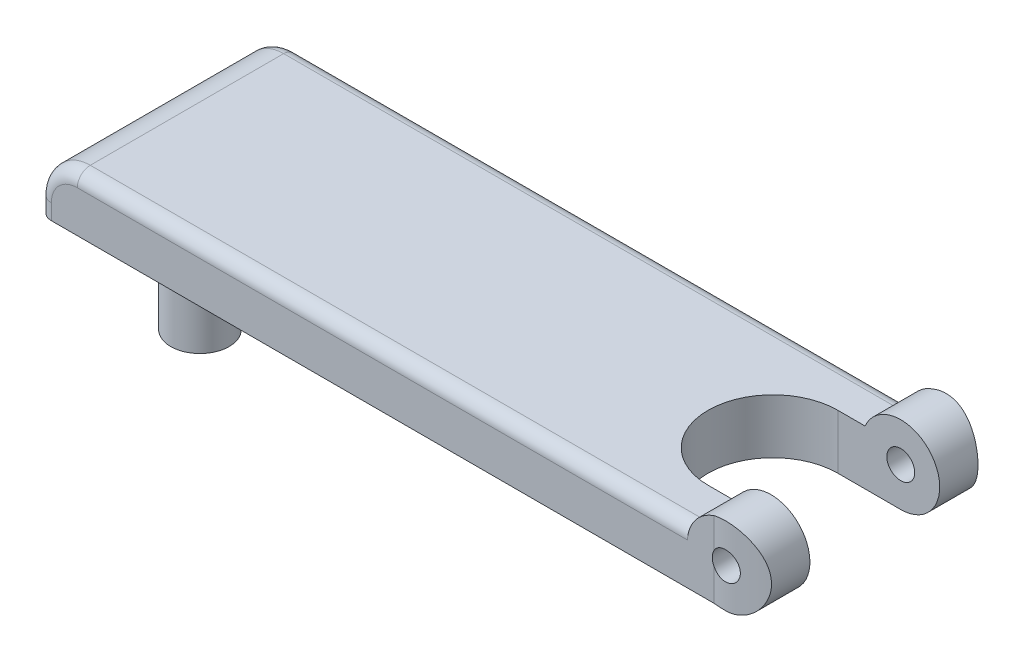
ISO-10303-21;
HEADER;
FILE_DESCRIPTION(('STEP AP214'),'2;1');
FILE_NAME('part.step','',(''),(''),'','','');
FILE_SCHEMA(('AUTOMOTIVE_DESIGN { 1 0 10303 214 1 1 1 1 }'));
ENDSEC;
DATA;
#1=APPLICATION_CONTEXT('core data for automotive mechanical design processes');
#2=APPLICATION_PROTOCOL_DEFINITION('international standard','automotive_design',2000,#1);
#3=PRODUCT_CONTEXT('',#1,'mechanical');
#4=PRODUCT('Part','Part','',(#3));
#5=PRODUCT_RELATED_PRODUCT_CATEGORY('part','',(#4));
#6=PRODUCT_DEFINITION_FORMATION('','',#4);
#7=PRODUCT_DEFINITION_CONTEXT('part definition',#1,'design');
#8=PRODUCT_DEFINITION('design','',#6,#7);
#9=PRODUCT_DEFINITION_SHAPE('','',#8);
#10=(LENGTH_UNIT() NAMED_UNIT(*) SI_UNIT(.MILLI.,.METRE.));
#11=(NAMED_UNIT(*) PLANE_ANGLE_UNIT() SI_UNIT($,.RADIAN.));
#12=(NAMED_UNIT(*) SI_UNIT($,.STERADIAN.) SOLID_ANGLE_UNIT());
#13=UNCERTAINTY_MEASURE_WITH_UNIT(LENGTH_MEASURE(1.E-05),#10,'distance_accuracy_value','');
#14=(GEOMETRIC_REPRESENTATION_CONTEXT(3) GLOBAL_UNCERTAINTY_ASSIGNED_CONTEXT((#13)) GLOBAL_UNIT_ASSIGNED_CONTEXT((#10,
#11,#12)) REPRESENTATION_CONTEXT('',''));
#15=CARTESIAN_POINT('',(0.,0.,0.));
#16=DIRECTION('',(0.,0.,1.));
#17=DIRECTION('',(1.,0.,0.));
#18=AXIS2_PLACEMENT_3D('',#15,#16,#17);
#19=CARTESIAN_POINT('',(-53.,0.,8.5));
#20=DIRECTION('',(0.,1.,0.));
#21=DIRECTION('',(0.,0.,1.));
#22=AXIS2_PLACEMENT_3D('',#19,#20,#21);
#23=PLANE('',#22);
#24=DIRECTION('',(0.,0.,1.));
#25=VECTOR('',#24,1.);
#26=CARTESIAN_POINT('',(-53.,0.,-8.5));
#27=LINE('',#26,#25);
#28=CARTESIAN_POINT('',(-53.,0.,-7.45000000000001));
#29=VERTEX_POINT('',#28);
#30=CARTESIAN_POINT('',(-53.,0.,7.44999999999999));
#31=VERTEX_POINT('',#30);
#32=EDGE_CURVE('E287',#29,#31,#27,.T.);
#33=ORIENTED_EDGE('',*,*,#32,.F.);
#34=CARTESIAN_POINT('',(-52.,0.,-7.45000000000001));
#35=DIRECTION('',(0.,1.,0.));
#36=DIRECTION('',(0.,0.,1.));
#37=AXIS2_PLACEMENT_3D('',#34,#35,#36);
#38=CIRCLE('',#37,1.);
#39=CARTESIAN_POINT('',(-52.,0.,-8.45000000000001));
#40=VERTEX_POINT('',#39);
#41=EDGE_CURVE('E397',#29,#40,#38,.F.);
#42=ORIENTED_EDGE('',*,*,#41,.T.);
#43=DIRECTION('',(1.,0.,0.));
#44=VECTOR('',#43,1.);
#45=CARTESIAN_POINT('',(-54.6802441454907,0.,-8.45000000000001));
#46=LINE('',#45,#44);
#47=CARTESIAN_POINT('',(-0.920597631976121,0.,-8.45));
#48=VERTEX_POINT('',#47);
#49=EDGE_CURVE('E174',#40,#48,#46,.T.);
#50=ORIENTED_EDGE('',*,*,#49,.T.);
#51=CARTESIAN_POINT('',(0.,0.,0.));
#52=DIRECTION('',(0.,-1.,0.));
#53=DIRECTION('',(0.,0.,-1.));
#54=AXIS2_PLACEMENT_3D('',#51,#52,#53);
#55=CIRCLE('',#54,8.5);
#56=CARTESIAN_POINT('',(0.,0.,-8.5));
#57=VERTEX_POINT('',#56);
#58=EDGE_CURVE('E188',#48,#57,#55,.T.);
#59=ORIENTED_EDGE('',*,*,#58,.T.);
#60=DIRECTION('',(0.,0.,-1.));
#61=VECTOR('',#60,1.);
#62=CARTESIAN_POINT('',(0.,0.,-8.5));
#63=LINE('',#62,#61);
#64=CARTESIAN_POINT('',(0.,0.,-5.));
#65=VERTEX_POINT('',#64);
#66=EDGE_CURVE('E288',#65,#57,#63,.T.);
#67=ORIENTED_EDGE('',*,*,#66,.F.);
#68=DIRECTION('',(-1.,0.,0.));
#69=VECTOR('',#68,1.);
#70=CARTESIAN_POINT('',(6.87386354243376,0.,-5.));
#71=LINE('',#70,#69);
#72=CARTESIAN_POINT('',(-4.85,0.,-5.));
#73=VERTEX_POINT('',#72);
#74=EDGE_CURVE('E191',#65,#73,#71,.T.);
#75=ORIENTED_EDGE('',*,*,#74,.T.);
#76=CARTESIAN_POINT('',(-4.85,0.,0.));
#77=DIRECTION('',(0.,1.,0.));
#78=DIRECTION('',(0.,0.,-1.));
#79=AXIS2_PLACEMENT_3D('',#76,#77,#78);
#80=CIRCLE('',#79,5.);
#81=CARTESIAN_POINT('',(-4.85,0.,5.));
#82=VERTEX_POINT('',#81);
#83=EDGE_CURVE('E183',#73,#82,#80,.T.);
#84=ORIENTED_EDGE('',*,*,#83,.T.);
#85=DIRECTION('',(1.,0.,0.));
#86=VECTOR('',#85,1.);
#87=CARTESIAN_POINT('',(6.87386354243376,0.,5.));
#88=LINE('',#87,#86);
#89=CARTESIAN_POINT('',(0.,0.,5.));
#90=VERTEX_POINT('',#89);
#91=EDGE_CURVE('E181',#82,#90,#88,.T.);
#92=ORIENTED_EDGE('',*,*,#91,.T.);
#93=CARTESIAN_POINT('',(0.,0.,8.5));
#94=VERTEX_POINT('',#93);
#95=EDGE_CURVE('E180',#94,#90,#63,.T.);
#96=ORIENTED_EDGE('',*,*,#95,.F.);
#97=CARTESIAN_POINT('',(0.,0.,0.));
#98=DIRECTION('',(0.,-1.,0.));
#99=DIRECTION('',(0.,0.,-1.));
#100=AXIS2_PLACEMENT_3D('',#97,#98,#99);
#101=CIRCLE('',#100,8.5);
#102=CARTESIAN_POINT('',(-0.920597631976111,0.,8.45));
#103=VERTEX_POINT('',#102);
#104=EDGE_CURVE('E160',#94,#103,#101,.T.);
#105=ORIENTED_EDGE('',*,*,#104,.T.);
#106=DIRECTION('',(-1.,0.,0.));
#107=VECTOR('',#106,1.);
#108=CARTESIAN_POINT('',(-0.920597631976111,0.,8.45));
#109=LINE('',#108,#107);
#110=CARTESIAN_POINT('',(-52.,0.,8.44999999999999));
#111=VERTEX_POINT('',#110);
#112=EDGE_CURVE('E170',#103,#111,#109,.T.);
#113=ORIENTED_EDGE('',*,*,#112,.T.);
#114=CARTESIAN_POINT('',(-52.,0.,7.44999999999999));
#115=DIRECTION('',(0.,1.,0.));
#116=DIRECTION('',(0.,0.,1.));
#117=AXIS2_PLACEMENT_3D('',#114,#115,#116);
#118=CIRCLE('',#117,1.);
#119=EDGE_CURVE('E51',#111,#31,#118,.F.);
#120=ORIENTED_EDGE('',*,*,#119,.T.);
#121=EDGE_LOOP('',(#33,#42,#50,#59,#67,#75,#84,#92,#96,#105,#113,#120));
#122=FACE_BOUND('',#121,.T.);
#123=CARTESIAN_POINT('',(-49.,0.,0.));
#124=DIRECTION('',(0.,1.,0.));
#125=DIRECTION('',(0.,0.,1.));
#126=AXIS2_PLACEMENT_3D('',#123,#124,#125);
#127=CIRCLE('',#126,2.25);
#128=CARTESIAN_POINT('',(-49.,0.,2.25));
#129=VERTEX_POINT('',#128);
#130=EDGE_CURVE('E13',#129,#129,#127,.F.);
#131=ORIENTED_EDGE('',*,*,#130,.F.);
#132=EDGE_LOOP('',(#131));
#133=FACE_BOUND('',#132,.T.);
#134=ADVANCED_FACE('F36',(#122,#133),#23,.F.);
#135=CARTESIAN_POINT('',(0.,3.,-8.5));
#136=DIRECTION('',(0.,0.,1.));
#137=DIRECTION('',(1.,0.,0.));
#138=AXIS2_PLACEMENT_3D('',#135,#136,#137);
#139=CYLINDRICAL_SURFACE('',#138,1.075);
#140=CARTESIAN_POINT('',(-0.920597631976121,2.44490991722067,-8.45));
#141=CARTESIAN_POINT('',(-0.90495556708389,2.41896870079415,-8.45170372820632));
#142=CARTESIAN_POINT('',(-0.888226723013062,2.39370504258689,-8.45348270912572));
#143=CARTESIAN_POINT('',(-0.852703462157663,2.34468404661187,-8.45714004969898));
#144=CARTESIAN_POINT('',(-0.833909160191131,2.32092662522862,-8.45901840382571));
#145=CARTESIAN_POINT('',(-0.774643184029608,2.2522011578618,-8.46472076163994));
#146=CARTESIAN_POINT('',(-0.731243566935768,2.20970566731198,-8.46861717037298));
#147=CARTESIAN_POINT('',(-0.637907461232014,2.13260755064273,-8.47615858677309));
#148=CARTESIAN_POINT('',(-0.587968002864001,2.09800853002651,-8.47980347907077));
#149=CARTESIAN_POINT('',(-0.482953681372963,2.03768818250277,-8.48643142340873));
#150=CARTESIAN_POINT('',(-0.42788009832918,2.01196465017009,-8.48941463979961));
#151=CARTESIAN_POINT('',(-0.314272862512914,1.97018773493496,-8.49437789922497));
#152=CARTESIAN_POINT('',(-0.25574693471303,1.95411359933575,-8.49636009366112));
#153=CARTESIAN_POINT('',(-0.136789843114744,1.93202385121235,-8.49910738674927));
#154=CARTESIAN_POINT('',(-0.0763584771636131,1.92600930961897,-8.49987235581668));
#155=CARTESIAN_POINT('',(0.0442278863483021,1.92423074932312,-8.50009728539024));
#156=CARTESIAN_POINT('',(0.1043818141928,1.92839450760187,-8.49956644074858));
#157=CARTESIAN_POINT('',(0.223123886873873,1.9466960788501,-8.49727856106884));
#158=CARTESIAN_POINT('',(0.281712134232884,1.96083323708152,-8.49552160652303));
#159=CARTESIAN_POINT('',(0.395631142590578,1.99865063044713,-8.49097909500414));
#160=CARTESIAN_POINT('',(0.450964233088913,2.02232394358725,-8.48819428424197));
#161=CARTESIAN_POINT('',(0.55688530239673,2.07853432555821,-8.48190410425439));
#162=CARTESIAN_POINT('',(0.60747297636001,2.11107196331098,-8.47839868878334));
#163=CARTESIAN_POINT('',(0.702829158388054,2.18434349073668,-8.47102927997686));
#164=CARTESIAN_POINT('',(0.747556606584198,2.22513059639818,-8.46716305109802));
#165=CARTESIAN_POINT('',(0.829551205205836,2.31362645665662,-8.45952389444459));
#166=CARTESIAN_POINT('',(0.866818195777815,2.36133535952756,-8.45575096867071));
#167=CARTESIAN_POINT('',(0.93297262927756,2.46254685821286,-8.44870859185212));
#168=CARTESIAN_POINT('',(0.961827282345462,2.51607103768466,-8.44544113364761));
#169=CARTESIAN_POINT('',(1.01012756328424,2.62725277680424,-8.4398007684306));
#170=CARTESIAN_POINT('',(1.02957352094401,2.68491019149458,-8.43742783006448));
#171=CARTESIAN_POINT('',(1.05840746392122,2.8024149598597,-8.43385947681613));
#172=CARTESIAN_POINT('',(1.0678455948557,2.8622498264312,-8.43265819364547));
#173=CARTESIAN_POINT('',(1.07655380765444,2.98266567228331,-8.43155098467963));
#174=CARTESIAN_POINT('',(1.07582431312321,3.04324662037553,-8.4316450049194));
#175=CARTESIAN_POINT('',(1.06425613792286,3.16304393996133,-8.43311279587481));
#176=CARTESIAN_POINT('',(1.05347918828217,3.22226638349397,-8.43447875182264));
#177=CARTESIAN_POINT('',(1.02222322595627,3.33805449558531,-8.43832360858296));
#178=CARTESIAN_POINT('',(1.0017440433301,3.39462011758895,-8.44080252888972));
#179=CARTESIAN_POINT('',(0.95161603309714,3.50364734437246,-8.44660059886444));
#180=CARTESIAN_POINT('',(0.921945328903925,3.55609877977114,-8.44992174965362));
#181=CARTESIAN_POINT('',(0.854290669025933,3.65529945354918,-8.45702906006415));
#182=CARTESIAN_POINT('',(0.816306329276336,3.70204842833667,-8.46081524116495));
#183=CARTESIAN_POINT('',(0.732779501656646,3.78886849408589,-8.46845920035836));
#184=CARTESIAN_POINT('',(0.687184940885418,3.82888947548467,-8.47231729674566));
#185=CARTESIAN_POINT('',(0.589901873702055,3.90072009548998,-8.47964569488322));
#186=CARTESIAN_POINT('',(0.538213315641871,3.93252966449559,-8.48311599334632));
#187=CARTESIAN_POINT('',(0.430144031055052,3.98704946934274,-8.4892817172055));
#188=CARTESIAN_POINT('',(0.373759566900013,4.00975237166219,-8.49197651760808));
#189=CARTESIAN_POINT('',(0.257936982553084,4.04535333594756,-8.4962829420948));
#190=CARTESIAN_POINT('',(0.198499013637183,4.05825188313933,-8.49789461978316));
#191=CARTESIAN_POINT('',(0.0786820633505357,4.07380599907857,-8.49984554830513));
#192=CARTESIAN_POINT('',(0.0183120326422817,4.07652948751,-8.50019323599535));
#193=CARTESIAN_POINT('',(-0.102024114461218,4.0718401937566,-8.49960065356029));
#194=CARTESIAN_POINT('',(-0.161990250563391,4.06442790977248,-8.49866044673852));
#195=CARTESIAN_POINT('',(-0.279580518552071,4.03973826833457,-8.49560374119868));
#196=CARTESIAN_POINT('',(-0.337212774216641,4.02249897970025,-8.4934917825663));
#197=CARTESIAN_POINT('',(-0.448780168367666,3.9786794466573,-8.48832835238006));
#198=CARTESIAN_POINT('',(-0.502714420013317,3.95209697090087,-8.48527665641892));
#199=CARTESIAN_POINT('',(-0.605653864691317,3.89018961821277,-8.478553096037));
#200=CARTESIAN_POINT('',(-0.654630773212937,3.8548181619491,-8.47487796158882));
#201=CARTESIAN_POINT('',(-0.745941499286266,3.77640755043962,-8.46732960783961));
#202=CARTESIAN_POINT('',(-0.788282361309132,3.73337663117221,-8.46345660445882));
#203=CARTESIAN_POINT('',(-0.844001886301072,3.66634915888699,-8.45801185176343));
#204=CARTESIAN_POINT('',(-0.860506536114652,3.64489270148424,-8.45634545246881));
#205=CARTESIAN_POINT('',(-0.891825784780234,3.60083256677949,-8.45309958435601));
#206=CARTESIAN_POINT('',(-0.906643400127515,3.57823104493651,-8.45151996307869));
#207=CARTESIAN_POINT('',(-0.920597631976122,3.55509008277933,-8.45));
#208=B_SPLINE_CURVE_WITH_KNOTS('',3,(#140,#141,#142,#143,#144,#145,#146,#147,#148,#149,#150,
#151,#152,#153,#154,#155,#156,#157,#158,#159,#160,#161,#162,#163,#164,#165,#166,#167,#168,#169,
#170,#171,#172,#173,#174,#175,#176,#177,#178,#179,#180,#181,#182,#183,#184,#185,#186,#187,#188,
#189,#190,#191,#192,#193,#194,#195,#196,#197,#198,#199,#200,#201,#202,#203,#204,#205,#206,#207),
.UNSPECIFIED.,.F.,.F.,(4,2,2,2,2,2,2,2,2,2,2,2,2,2,2,2,2,2,2,2,2,2,2,2,2,2,2,2,2,2,2,2,2,4),(0.,
0.0909640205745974,0.181922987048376,0.36358353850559,0.545326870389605,0.72702500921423,
0.908330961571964,1.08965621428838,1.26969856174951,1.44972909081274,1.6296291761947,
1.80954081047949,1.99065232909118,2.17176772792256,2.35357992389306,2.53538574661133,
2.7162762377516,2.89715919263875,3.07693808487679,3.25672012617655,3.4369333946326,
3.61715499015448,3.79866450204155,3.98017555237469,4.16183247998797,4.34348041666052,
4.52391364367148,4.70433800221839,4.88406811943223,5.06384118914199,5.24458812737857,
5.42514187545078,5.50644120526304,5.5875928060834),.UNSPECIFIED.);
#209=CARTESIAN_POINT('',(-0.920597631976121,2.44490991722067,-8.45));
#210=VERTEX_POINT('',#209);
#211=CARTESIAN_POINT('',(-0.920597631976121,3.55509008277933,-8.45));
#212=VERTEX_POINT('',#211);
#213=EDGE_CURVE('E247',#210,#212,#208,.T.);
#214=ORIENTED_EDGE('',*,*,#213,.F.);
#215=CARTESIAN_POINT('',(0.,3.,-8.45));
#216=DIRECTION('',(0.,0.,-1.));
#217=DIRECTION('',(-1.,0.,0.));
#218=AXIS2_PLACEMENT_3D('',#215,#216,#217);
#219=CIRCLE('',#218,1.075);
#220=EDGE_CURVE('E255',#212,#210,#219,.F.);
#221=ORIENTED_EDGE('',*,*,#220,.F.);
#222=EDGE_LOOP('',(#214,#221));
#223=FACE_BOUND('',#222,.T.);
#224=CARTESIAN_POINT('',(0.,3.,-5.));
#225=DIRECTION('',(0.,0.,1.));
#226=DIRECTION('',(1.,0.,0.));
#227=AXIS2_PLACEMENT_3D('',#224,#225,#226);
#228=CIRCLE('',#227,1.075);
#229=CARTESIAN_POINT('',(1.075,3.,-5.));
#230=VERTEX_POINT('',#229);
#231=EDGE_CURVE('E256',#230,#230,#228,.F.);
#232=ORIENTED_EDGE('',*,*,#231,.F.);
#233=EDGE_LOOP('',(#232));
#234=FACE_BOUND('',#233,.T.);
#235=ADVANCED_FACE('F239',(#223,#234),#139,.F.);
#236=CARTESIAN_POINT('',(6.87386354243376,17.,-5.));
#237=DIRECTION('',(0.,0.,1.));
#238=DIRECTION('',(1.,0.,0.));
#239=AXIS2_PLACEMENT_3D('',#236,#237,#238);
#240=PLANE('',#239);
#241=DIRECTION('',(0.,-1.,0.));
#242=VECTOR('',#241,1.);
#243=CARTESIAN_POINT('',(-4.85,17.,-5.));
#244=LINE('',#243,#242);
#245=CARTESIAN_POINT('',(-4.85,4.2,-5.));
#246=VERTEX_POINT('',#245);
#247=EDGE_CURVE('E194',#246,#73,#244,.T.);
#248=ORIENTED_EDGE('',*,*,#247,.T.);
#249=ORIENTED_EDGE('',*,*,#74,.F.);
#250=CARTESIAN_POINT('',(0.,3.,-5.));
#251=DIRECTION('',(0.,0.,1.));
#252=DIRECTION('',(1.,0.,0.));
#253=AXIS2_PLACEMENT_3D('',#250,#251,#252);
#254=CIRCLE('',#253,3.);
#255=CARTESIAN_POINT('',(-2.74954541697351,4.2,-5.));
#256=VERTEX_POINT('',#255);
#257=EDGE_CURVE('E274',#256,#65,#254,.F.);
#258=ORIENTED_EDGE('',*,*,#257,.F.);
#259=DIRECTION('',(1.,0.,0.));
#260=VECTOR('',#259,1.);
#261=CARTESIAN_POINT('',(-53.,4.2,-5.00000000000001));
#262=LINE('',#261,#260);
#263=EDGE_CURVE('E277',#246,#256,#262,.T.);
#264=ORIENTED_EDGE('',*,*,#263,.F.);
#265=EDGE_LOOP('',(#248,#249,#258,#264));
#266=FACE_BOUND('',#265,.T.);
#267=ORIENTED_EDGE('',*,*,#231,.T.);
#268=EDGE_LOOP('',(#267));
#269=FACE_BOUND('',#268,.T.);
#270=ADVANCED_FACE('F242',(#266,#269),#240,.T.);
#271=CARTESIAN_POINT('',(6.87386354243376,17.,5.));
#272=DIRECTION('',(0.,0.,-1.));
#273=DIRECTION('',(-1.,0.,0.));
#274=AXIS2_PLACEMENT_3D('',#271,#272,#273);
#275=PLANE('',#274);
#276=CARTESIAN_POINT('',(0.,3.,5.));
#277=DIRECTION('',(0.,0.,-1.));
#278=DIRECTION('',(-1.,0.,0.));
#279=AXIS2_PLACEMENT_3D('',#276,#277,#278);
#280=CIRCLE('',#279,3.);
#281=CARTESIAN_POINT('',(-2.74954541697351,4.2,5.));
#282=VERTEX_POINT('',#281);
#283=EDGE_CURVE('E202',#90,#282,#280,.F.);
#284=ORIENTED_EDGE('',*,*,#283,.F.);
#285=ORIENTED_EDGE('',*,*,#91,.F.);
#286=DIRECTION('',(0.,-1.,0.));
#287=VECTOR('',#286,1.);
#288=CARTESIAN_POINT('',(-4.85,17.,5.));
#289=LINE('',#288,#287);
#290=CARTESIAN_POINT('',(-4.85,4.2,5.));
#291=VERTEX_POINT('',#290);
#292=EDGE_CURVE('E168',#291,#82,#289,.T.);
#293=ORIENTED_EDGE('',*,*,#292,.F.);
#294=DIRECTION('',(-1.,0.,0.));
#295=VECTOR('',#294,1.);
#296=CARTESIAN_POINT('',(-53.,4.2,4.99999999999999));
#297=LINE('',#296,#295);
#298=EDGE_CURVE('E205',#282,#291,#297,.T.);
#299=ORIENTED_EDGE('',*,*,#298,.F.);
#300=EDGE_LOOP('',(#284,#285,#293,#299));
#301=FACE_BOUND('',#300,.T.);
#302=CARTESIAN_POINT('',(0.,3.,5.));
#303=DIRECTION('',(0.,0.,-1.));
#304=DIRECTION('',(-1.,0.,0.));
#305=AXIS2_PLACEMENT_3D('',#302,#303,#304);
#306=CIRCLE('',#305,1.075);
#307=CARTESIAN_POINT('',(-1.075,3.,5.));
#308=VERTEX_POINT('',#307);
#309=EDGE_CURVE('E196',#308,#308,#306,.F.);
#310=ORIENTED_EDGE('',*,*,#309,.T.);
#311=EDGE_LOOP('',(#310));
#312=FACE_BOUND('',#311,.T.);
#313=ADVANCED_FACE('F227',(#301,#312),#275,.T.);
#314=CARTESIAN_POINT('',(-4.85,17.,0.));
#315=DIRECTION('',(0.,-1.,0.));
#316=DIRECTION('',(0.,0.,-1.));
#317=AXIS2_PLACEMENT_3D('',#314,#315,#316);
#318=CYLINDRICAL_SURFACE('',#317,5.);
#319=ORIENTED_EDGE('',*,*,#292,.T.);
#320=ORIENTED_EDGE('',*,*,#83,.F.);
#321=ORIENTED_EDGE('',*,*,#247,.F.);
#322=CARTESIAN_POINT('',(-4.85,4.2,0.));
#323=DIRECTION('',(0.,1.,0.));
#324=DIRECTION('',(0.,0.,1.));
#325=AXIS2_PLACEMENT_3D('',#322,#323,#324);
#326=CIRCLE('',#325,5.);
#327=EDGE_CURVE('E280',#291,#246,#326,.F.);
#328=ORIENTED_EDGE('',*,*,#327,.F.);
#329=EDGE_LOOP('',(#319,#320,#321,#328));
#330=FACE_BOUND('',#329,.T.);
#331=ADVANCED_FACE('F244',(#330),#318,.F.);
#332=CARTESIAN_POINT('',(0.,17.,0.));
#333=DIRECTION('',(0.,-1.,0.));
#334=DIRECTION('',(0.,0.,-1.));
#335=AXIS2_PLACEMENT_3D('',#332,#333,#334);
#336=CYLINDRICAL_SURFACE('',#335,8.5);
#337=CARTESIAN_POINT('',(0.,0.,-8.5));
#338=CARTESIAN_POINT('',(0.0816967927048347,-1.07410784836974E-05,-8.50001098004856));
#339=CARTESIAN_POINT('',(0.163386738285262,0.00333695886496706,-8.49882243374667));
#340=CARTESIAN_POINT('',(0.32613688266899,0.0166658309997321,-8.49412806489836));
#341=CARTESIAN_POINT('',(0.407197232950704,0.0266453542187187,-8.49062281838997));
#342=CARTESIAN_POINT('',(0.567878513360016,0.0531158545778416,-8.48139024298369));
#343=CARTESIAN_POINT('',(0.647502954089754,0.0695877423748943,-8.47566942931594));
#344=CARTESIAN_POINT('',(0.804972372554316,0.108873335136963,-8.46216736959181));
#345=CARTESIAN_POINT('',(0.88281729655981,0.131687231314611,-8.45438606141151));
#346=CARTESIAN_POINT('',(1.11280527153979,0.209340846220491,-8.42824791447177));
#347=CARTESIAN_POINT('',(1.26162459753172,0.273429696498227,-8.40708320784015));
#348=CARTESIAN_POINT('',(1.5463614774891,0.424192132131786,-8.35940760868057));
#349=CARTESIAN_POINT('',(1.68227166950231,0.510878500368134,-8.33289369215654));
#350=CARTESIAN_POINT('',(1.94256506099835,0.707846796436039,-8.27615740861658));
#351=CARTESIAN_POINT('',(2.06639274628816,0.818836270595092,-8.24583901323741));
#352=CARTESIAN_POINT('',(2.29411313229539,1.05975759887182,-8.18541135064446));
#353=CARTESIAN_POINT('',(2.39800003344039,1.18969494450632,-8.15530214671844));
#354=CARTESIAN_POINT('',(2.586249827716,1.47005323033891,-8.09761343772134));
#355=CARTESIAN_POINT('',(2.66985705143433,1.62100783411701,-8.07014990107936));
#356=CARTESIAN_POINT('',(2.81024930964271,1.9359542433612,-8.02234630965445));
#357=CARTESIAN_POINT('',(2.86704468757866,2.09994099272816,-8.00200350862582));
#358=CARTESIAN_POINT('',(2.95005819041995,2.42990396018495,-7.971766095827));
#359=CARTESIAN_POINT('',(2.9773333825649,2.59558021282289,-7.96151157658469));
#360=CARTESIAN_POINT('',(3.00383763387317,2.92945317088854,-7.95155202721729));
#361=CARTESIAN_POINT('',(3.00307623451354,3.09764899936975,-7.95184340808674));
#362=CARTESIAN_POINT('',(2.9743432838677,3.42247554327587,-7.96262987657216));
#363=CARTESIAN_POINT('',(2.94779009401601,3.57925254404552,-7.97259306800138));
#364=CARTESIAN_POINT('',(2.87055528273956,3.88596316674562,-8.00072396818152));
#365=CARTESIAN_POINT('',(2.81987047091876,4.03589588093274,-8.01889276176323));
#366=CARTESIAN_POINT('',(2.69495250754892,4.32773170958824,-8.0617393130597));
#367=CARTESIAN_POINT('',(2.62032338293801,4.46944875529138,-8.08652525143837));
#368=CARTESIAN_POINT('',(2.44991103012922,4.7387786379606,-8.13977201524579));
#369=CARTESIAN_POINT('',(2.35412127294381,4.86638710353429,-8.16823397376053));
#370=CARTESIAN_POINT('',(2.13744315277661,5.1117954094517,-8.22767671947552));
#371=CARTESIAN_POINT('',(2.01540754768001,5.22857257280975,-8.25870704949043));
#372=CARTESIAN_POINT('',(1.75311116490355,5.44028882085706,-8.31833329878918));
#373=CARTESIAN_POINT('',(1.61284808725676,5.5352251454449,-8.34692891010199));
#374=CARTESIAN_POINT('',(1.31572015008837,5.70151926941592,-8.39892104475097));
#375=CARTESIAN_POINT('',(1.15867301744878,5.77257408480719,-8.42224961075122));
#376=CARTESIAN_POINT('',(0.83380810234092,5.88693287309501,-8.46058246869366));
#377=CARTESIAN_POINT('',(0.665993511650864,5.93024502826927,-8.47558921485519));
#378=CARTESIAN_POINT('',(0.332982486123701,5.9860132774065,-8.49503570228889));
#379=CARTESIAN_POINT('',(0.168041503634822,5.99983968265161,-8.49994432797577));
#380=CARTESIAN_POINT('',(-0.161812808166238,6.00015709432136,-8.50005453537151));
#381=CARTESIAN_POINT('',(-0.326726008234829,5.98667468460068,-8.4952655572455));
#382=CARTESIAN_POINT('',(-0.562304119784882,5.94777342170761,-8.48170181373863));
#383=CARTESIAN_POINT('',(-0.635086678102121,5.93294651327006,-8.47655008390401));
#384=CARTESIAN_POINT('',(-0.7790714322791,5.89801883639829,-8.46452889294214));
#385=CARTESIAN_POINT('',(-0.850276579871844,5.87792901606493,-8.45766299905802));
#386=CARTESIAN_POINT('',(-0.920597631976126,5.85525830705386,-8.45000000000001));
#387=B_SPLINE_CURVE_WITH_KNOTS('',3,(#337,#338,#339,#340,#341,#342,#343,#344,#345,#346,#347,
#348,#349,#350,#351,#352,#353,#354,#355,#356,#357,#358,#359,#360,#361,#362,#363,#364,#365,#366,
#367,#368,#369,#370,#371,#372,#373,#374,#375,#376,#377,#378,#379,#380,#381,#382,#383,#384,#385,
#386),.UNSPECIFIED.,.F.,.F.,(4,2,2,2,2,2,2,2,2,2,2,2,2,2,2,2,2,2,2,2,2,2,2,2,4),(0.,
0.245001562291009,0.489942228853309,0.73416801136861,0.97840115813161,1.46619631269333,
1.95426800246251,2.45908620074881,2.96405099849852,3.48564601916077,4.00703965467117,
4.50907327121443,5.01093603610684,5.48667665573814,5.96248018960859,6.4465971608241,
6.93086371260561,7.44369737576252,7.9565958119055,8.47577528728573,8.99480156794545,
9.48912806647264,9.98297359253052,10.2061556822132,10.42887713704),.UNSPECIFIED.);
#388=CARTESIAN_POINT('',(-0.920597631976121,5.85525830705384,-8.45));
#389=VERTEX_POINT('',#388);
#390=EDGE_CURVE('E267',#57,#389,#387,.T.);
#391=ORIENTED_EDGE('',*,*,#390,.F.);
#392=ORIENTED_EDGE('',*,*,#58,.F.);
#393=DIRECTION('',(0.,-1.,0.));
#394=VECTOR('',#393,1.);
#395=CARTESIAN_POINT('',(-0.920597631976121,17.,-8.45));
#396=LINE('',#395,#394);
#397=EDGE_CURVE('E198',#210,#48,#396,.T.);
#398=ORIENTED_EDGE('',*,*,#397,.F.);
#399=ORIENTED_EDGE('',*,*,#213,.T.);
#400=EDGE_CURVE('E197',#389,#212,#396,.T.);
#401=ORIENTED_EDGE('',*,*,#400,.F.);
#402=EDGE_LOOP('',(#391,#392,#398,#399,#401));
#403=FACE_BOUND('',#402,.T.);
#404=ADVANCED_FACE('F258',(#403),#336,.T.);
#405=CARTESIAN_POINT('',(-54.6802441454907,17.,-8.45000000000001));
#406=DIRECTION('',(0.,0.,-1.));
#407=DIRECTION('',(-1.,0.,0.));
#408=AXIS2_PLACEMENT_3D('',#405,#406,#407);
#409=PLANE('',#408);
#410=DIRECTION('',(-1.,0.,0.));
#411=VECTOR('',#410,1.);
#412=CARTESIAN_POINT('',(-54.6802441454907,3.2,-8.45000000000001));
#413=LINE('',#412,#411);
#414=CARTESIAN_POINT('',(-50.,3.2,-8.45000000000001));
#415=VERTEX_POINT('',#414);
#416=CARTESIAN_POINT('',(-2.99332590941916,3.2,-8.45));
#417=VERTEX_POINT('',#416);
#418=EDGE_CURVE('E304',#415,#417,#413,.F.);
#419=ORIENTED_EDGE('',*,*,#418,.T.);
#420=CARTESIAN_POINT('',(0.,3.,-8.45));
#421=DIRECTION('',(0.,0.,-1.));
#422=DIRECTION('',(-1.,0.,0.));
#423=AXIS2_PLACEMENT_3D('',#420,#421,#422);
#424=CIRCLE('',#423,3.);
#425=EDGE_CURVE('E273',#389,#417,#424,.F.);
#426=ORIENTED_EDGE('',*,*,#425,.F.);
#427=ORIENTED_EDGE('',*,*,#400,.T.);
#428=ORIENTED_EDGE('',*,*,#220,.T.);
#429=ORIENTED_EDGE('',*,*,#397,.T.);
#430=ORIENTED_EDGE('',*,*,#49,.F.);
#431=DIRECTION('',(0.,1.,0.));
#432=VECTOR('',#431,1.);
#433=CARTESIAN_POINT('',(-52.,1.2,-8.45000000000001));
#434=LINE('',#433,#432);
#435=CARTESIAN_POINT('',(-52.,1.2,-8.45000000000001));
#436=VERTEX_POINT('',#435);
#437=EDGE_CURVE('E377',#40,#436,#434,.T.);
#438=ORIENTED_EDGE('',*,*,#437,.T.);
#439=CARTESIAN_POINT('',(-50.,1.2,-8.45000000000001));
#440=DIRECTION('',(0.,0.,-1.));
#441=DIRECTION('',(-1.,0.,0.));
#442=AXIS2_PLACEMENT_3D('',#439,#440,#441);
#443=CIRCLE('',#442,2.);
#444=EDGE_CURVE('E382',#436,#415,#443,.T.);
#445=ORIENTED_EDGE('',*,*,#444,.T.);
#446=EDGE_LOOP('',(#419,#426,#427,#428,#429,#430,#438,#445));
#447=FACE_BOUND('',#446,.T.);
#448=ADVANCED_FACE('F262',(#447),#409,.T.);
#449=CARTESIAN_POINT('',(-53.,4.2,-8.5));
#450=DIRECTION('',(1.,0.,0.));
#451=DIRECTION('',(0.,0.,-1.));
#452=AXIS2_PLACEMENT_3D('',#449,#450,#451);
#453=PLANE('',#452);
#454=DIRECTION('',(0.,0.,1.));
#455=VECTOR('',#454,1.);
#456=CARTESIAN_POINT('',(-53.,1.2,-8.45000000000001));
#457=LINE('',#456,#455);
#458=CARTESIAN_POINT('',(-53.,1.2,7.44999999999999));
#459=VERTEX_POINT('',#458);
#460=CARTESIAN_POINT('',(-53.,1.2,-7.45000000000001));
#461=VERTEX_POINT('',#460);
#462=EDGE_CURVE('E375',#459,#461,#457,.F.);
#463=ORIENTED_EDGE('',*,*,#462,.T.);
#464=DIRECTION('',(0.,1.,0.));
#465=VECTOR('',#464,1.);
#466=CARTESIAN_POINT('',(-53.,0.,-7.45000000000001));
#467=LINE('',#466,#465);
#468=EDGE_CURVE('E58',#461,#29,#467,.F.);
#469=ORIENTED_EDGE('',*,*,#468,.T.);
#470=ORIENTED_EDGE('',*,*,#32,.T.);
#471=DIRECTION('',(0.,-1.,0.));
#472=VECTOR('',#471,1.);
#473=CARTESIAN_POINT('',(-53.,1.2,7.44999999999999));
#474=LINE('',#473,#472);
#475=EDGE_CURVE('E393',#31,#459,#474,.F.);
#476=ORIENTED_EDGE('',*,*,#475,.T.);
#477=EDGE_LOOP('',(#463,#469,#470,#476));
#478=FACE_BOUND('',#477,.T.);
#479=ADVANCED_FACE('F38',(#478),#453,.F.);
#480=CARTESIAN_POINT('',(-53.,4.2,8.5));
#481=DIRECTION('',(0.,1.,0.));
#482=DIRECTION('',(0.,0.,1.));
#483=AXIS2_PLACEMENT_3D('',#480,#481,#482);
#484=PLANE('',#483);
#485=DIRECTION('',(0.,0.,1.));
#486=VECTOR('',#485,1.);
#487=CARTESIAN_POINT('',(-2.74954541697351,4.2,-8.5));
#488=LINE('',#487,#486);
#489=CARTESIAN_POINT('',(-2.74954541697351,4.2,-7.45));
#490=VERTEX_POINT('',#489);
#491=EDGE_CURVE('E286',#490,#256,#488,.T.);
#492=ORIENTED_EDGE('',*,*,#491,.F.);
#493=DIRECTION('',(-1.,0.,0.));
#494=VECTOR('',#493,1.);
#495=CARTESIAN_POINT('',(-53.,4.2,-7.45000000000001));
#496=LINE('',#495,#494);
#497=CARTESIAN_POINT('',(-50.,4.2,-7.45000000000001));
#498=VERTEX_POINT('',#497);
#499=EDGE_CURVE('E374',#490,#498,#496,.T.);
#500=ORIENTED_EDGE('',*,*,#499,.T.);
#501=DIRECTION('',(0.,0.,1.));
#502=VECTOR('',#501,1.);
#503=CARTESIAN_POINT('',(-50.,4.2,8.44999999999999));
#504=LINE('',#503,#502);
#505=CARTESIAN_POINT('',(-50.,4.2,7.44999999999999));
#506=VERTEX_POINT('',#505);
#507=EDGE_CURVE('E254',#498,#506,#504,.T.);
#508=ORIENTED_EDGE('',*,*,#507,.T.);
#509=DIRECTION('',(1.,0.,0.));
#510=VECTOR('',#509,1.);
#511=CARTESIAN_POINT('',(-53.,4.2,7.44999999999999));
#512=LINE('',#511,#510);
#513=CARTESIAN_POINT('',(-2.74954541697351,4.2,7.45));
#514=VERTEX_POINT('',#513);
#515=EDGE_CURVE('E369',#506,#514,#512,.T.);
#516=ORIENTED_EDGE('',*,*,#515,.T.);
#517=EDGE_CURVE('E283',#282,#514,#488,.T.);
#518=ORIENTED_EDGE('',*,*,#517,.F.);
#519=ORIENTED_EDGE('',*,*,#298,.T.);
#520=ORIENTED_EDGE('',*,*,#327,.T.);
#521=ORIENTED_EDGE('',*,*,#263,.T.);
#522=EDGE_LOOP('',(#492,#500,#508,#516,#518,#519,#520,#521));
#523=FACE_BOUND('',#522,.T.);
#524=ADVANCED_FACE('F366',(#523),#484,.T.);
#525=CARTESIAN_POINT('',(0.,3.,-8.5));
#526=DIRECTION('',(0.,0.,1.));
#527=DIRECTION('',(1.,0.,0.));
#528=AXIS2_PLACEMENT_3D('',#525,#526,#527);
#529=CYLINDRICAL_SURFACE('',#528,3.);
#530=ORIENTED_EDGE('',*,*,#425,.T.);
#531=CARTESIAN_POINT('',(-2.99332590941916,3.2,-8.45));
#532=CARTESIAN_POINT('',(-2.99147489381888,3.22773550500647,-8.45000064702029));
#533=CARTESIAN_POINT('',(-2.98923468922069,3.25542996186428,-8.44884544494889));
#534=CARTESIAN_POINT('',(-2.98401122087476,3.31054998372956,-8.44425531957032));
#535=CARTESIAN_POINT('',(-2.98102819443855,3.33797563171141,-8.44082112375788));
#536=CARTESIAN_POINT('',(-2.97104219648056,3.41937966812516,-8.42718309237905));
#537=CARTESIAN_POINT('',(-2.96298702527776,3.47270835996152,-8.4136432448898));
#538=CARTESIAN_POINT('',(-2.94465013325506,3.5760161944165,-8.37822261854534));
#539=CARTESIAN_POINT('',(-2.93437012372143,3.62599787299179,-8.35634824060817));
#540=CARTESIAN_POINT('',(-2.91234921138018,3.72154545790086,-8.30494720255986));
#541=CARTESIAN_POINT('',(-2.90060725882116,3.76710814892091,-8.27541502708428));
#542=CARTESIAN_POINT('',(-2.87610272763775,3.85450372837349,-8.20814715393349));
#543=CARTESIAN_POINT('',(-2.86331810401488,3.89611387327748,-8.17013005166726));
#544=CARTESIAN_POINT('',(-2.83829772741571,3.9724623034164,-8.08754590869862));
#545=CARTESIAN_POINT('',(-2.82606214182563,4.00719850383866,-8.04297688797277));
#546=CARTESIAN_POINT('',(-2.80308043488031,4.06951873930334,-7.94726199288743));
#547=CARTESIAN_POINT('',(-2.79237289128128,4.0969290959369,-7.89599325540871));
#548=CARTESIAN_POINT('',(-2.7740170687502,4.14255807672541,-7.78904621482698));
#549=CARTESIAN_POINT('',(-2.76636417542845,4.16079057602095,-7.73337471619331));
#550=CARTESIAN_POINT('',(-2.75707695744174,4.18263051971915,-7.63941973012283));
#551=CARTESIAN_POINT('',(-2.75427271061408,4.18912579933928,-7.60190022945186));
#552=CARTESIAN_POINT('',(-2.75049836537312,4.19781688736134,-7.52626366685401));
#553=CARTESIAN_POINT('',(-2.74952892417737,4.20001115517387,-7.48814639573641));
#554=CARTESIAN_POINT('',(-2.74954541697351,4.2,-7.45));
#555=B_SPLINE_CURVE_WITH_KNOTS('',3,(#531,#532,#533,#534,#535,#536,#537,#538,#539,#540,#541,
#542,#543,#544,#545,#546,#547,#548,#549,#550,#551,#552,#553,#554),.UNSPECIFIED.,.F.,.F.,(4,2,2,
2,2,2,2,2,2,2,2,4),(0.,0.0833360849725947,0.166645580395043,0.332602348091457,0.498431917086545,
0.664381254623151,0.836983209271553,1.00963743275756,1.18608046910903,1.36225595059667,
1.476525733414,1.5908364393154),.UNSPECIFIED.);
#556=EDGE_CURVE('E399',#417,#490,#555,.T.);
#557=ORIENTED_EDGE('',*,*,#556,.T.);
#558=ORIENTED_EDGE('',*,*,#491,.T.);
#559=ORIENTED_EDGE('',*,*,#257,.T.);
#560=ORIENTED_EDGE('',*,*,#66,.T.);
#561=ORIENTED_EDGE('',*,*,#390,.T.);
#562=EDGE_LOOP('',(#530,#557,#558,#559,#560,#561));
#563=FACE_BOUND('',#562,.T.);
#564=ADVANCED_FACE('F217',(#563),#529,.T.);
#565=ORIENTED_EDGE('',*,*,#517,.T.);
#566=CARTESIAN_POINT('',(-2.74954541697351,4.2,7.45));
#567=CARTESIAN_POINT('',(-2.74954242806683,4.20000112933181,7.47684064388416));
#568=CARTESIAN_POINT('',(-2.7500175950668,4.19891865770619,7.50366722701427));
#569=CARTESIAN_POINT('',(-2.75189351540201,4.19460889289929,7.55710560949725));
#570=CARTESIAN_POINT('',(-2.75329394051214,4.19138236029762,7.58371748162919));
#571=CARTESIAN_POINT('',(-2.7588200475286,4.17855971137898,7.66272933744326));
#572=CARTESIAN_POINT('',(-2.76427115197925,4.16582004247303,7.71456330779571));
#573=CARTESIAN_POINT('',(-2.77809852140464,4.13247028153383,7.8151142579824));
#574=CARTESIAN_POINT('',(-2.78647209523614,4.11186742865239,7.86383405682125));
#575=CARTESIAN_POINT('',(-2.80530411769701,4.06345755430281,7.95715519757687));
#576=CARTESIAN_POINT('',(-2.81576442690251,4.0356440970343,8.00175281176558));
#577=CARTESIAN_POINT('',(-2.8383722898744,3.97202628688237,8.08795415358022));
#578=CARTESIAN_POINT('',(-2.85057764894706,3.93589520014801,8.12930134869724));
#579=CARTESIAN_POINT('',(-2.875163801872,3.8573936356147,8.20553181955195));
#580=CARTESIAN_POINT('',(-2.88754465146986,3.81502113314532,8.2404129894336));
#581=CARTESIAN_POINT('',(-2.91206766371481,3.72267269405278,8.30447621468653));
#582=CARTESIAN_POINT('',(-2.92416539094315,3.67241906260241,8.33327652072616));
#583=CARTESIAN_POINT('',(-2.94635141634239,3.56735206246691,8.38187759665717));
#584=CARTESIAN_POINT('',(-2.95644170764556,3.51254329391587,8.40168731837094));
#585=CARTESIAN_POINT('',(-2.971496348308,3.41469726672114,8.42762607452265));
#586=CARTESIAN_POINT('',(-2.97711105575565,3.37233824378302,8.43597964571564));
#587=CARTESIAN_POINT('',(-2.98658629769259,3.28668672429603,8.44717593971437));
#588=CARTESIAN_POINT('',(-2.99044595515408,3.24339377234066,8.45001590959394));
#589=CARTESIAN_POINT('',(-2.99332590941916,3.2,8.45));
#590=B_SPLINE_CURVE_WITH_KNOTS('',3,(#566,#567,#568,#569,#570,#571,#572,#573,#574,#575,#576,
#577,#578,#579,#580,#581,#582,#583,#584,#585,#586,#587,#588,#589),.UNSPECIFIED.,.F.,.F.,(4,2,2,
2,2,2,2,2,2,2,2,4),(0.,0.0804686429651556,0.160908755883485,0.321026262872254,0.480996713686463,
0.641110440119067,0.809129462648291,0.977203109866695,1.15385520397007,1.33033101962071,
1.46056935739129,1.5908727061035),.UNSPECIFIED.);
#591=CARTESIAN_POINT('',(-2.99332590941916,3.2,8.45));
#592=VERTEX_POINT('',#591);
#593=EDGE_CURVE('E44',#514,#592,#590,.T.);
#594=ORIENTED_EDGE('',*,*,#593,.T.);
#595=CARTESIAN_POINT('',(0.,3.,8.45));
#596=DIRECTION('',(0.,0.,1.));
#597=DIRECTION('',(1.,0.,0.));
#598=AXIS2_PLACEMENT_3D('',#595,#596,#597);
#599=CIRCLE('',#598,3.);
#600=CARTESIAN_POINT('',(-0.920597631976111,5.85525830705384,8.45));
#601=VERTEX_POINT('',#600);
#602=EDGE_CURVE('E215',#592,#601,#599,.F.);
#603=ORIENTED_EDGE('',*,*,#602,.T.);
#604=CARTESIAN_POINT('',(-0.920597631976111,5.85525830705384,8.45));
#605=CARTESIAN_POINT('',(-0.844661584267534,5.8797510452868,8.45828200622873));
#606=CARTESIAN_POINT('',(-0.767648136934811,5.90122807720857,8.46562772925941));
#607=CARTESIAN_POINT('',(-0.611991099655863,5.93800094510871,8.47829730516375));
#608=CARTESIAN_POINT('',(-0.533347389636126,5.95329632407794,8.48362100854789));
#609=CARTESIAN_POINT('',(-0.37507309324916,5.97753601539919,8.49209023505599));
#610=CARTESIAN_POINT('',(-0.295443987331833,5.98648889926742,8.49523869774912));
#611=CARTESIAN_POINT('',(-0.135694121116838,5.99800104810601,8.49929336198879));
#612=CARTESIAN_POINT('',(-0.0555733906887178,6.00056069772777,8.50019969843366));
#613=CARTESIAN_POINT('',(0.184849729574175,5.99857681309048,8.49949408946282));
#614=CARTESIAN_POINT('',(0.345186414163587,5.98436638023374,8.49445608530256));
#615=CARTESIAN_POINT('',(0.660904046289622,5.93068070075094,8.47574668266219));
#616=CARTESIAN_POINT('',(0.816285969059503,5.89121045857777,8.46207699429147));
#617=CARTESIAN_POINT('',(1.11830221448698,5.788346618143,8.42748690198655));
#618=CARTESIAN_POINT('',(1.26492348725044,5.72491831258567,8.40655598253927));
#619=CARTESIAN_POINT('',(1.54566959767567,5.57607843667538,8.35949801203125));
#620=CARTESIAN_POINT('',(1.6797884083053,5.49065633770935,8.33336847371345));
#621=CARTESIAN_POINT('',(1.93871072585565,5.29541962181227,8.27706513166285));
#622=CARTESIAN_POINT('',(2.06274206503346,5.18461937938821,8.24675631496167));
#623=CARTESIAN_POINT('',(2.29088496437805,4.94405252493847,8.18631800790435));
#624=CARTESIAN_POINT('',(2.39499249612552,4.81428208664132,8.15618855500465));
#625=CARTESIAN_POINT('',(2.58370375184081,4.53424184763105,8.09842910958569));
#626=CARTESIAN_POINT('',(2.6675547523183,4.38343882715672,8.07091368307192));
#627=CARTESIAN_POINT('',(2.8084652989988,4.0687447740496,8.02297349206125));
#628=CARTESIAN_POINT('',(2.86553353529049,3.90485800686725,8.00254642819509));
#629=CARTESIAN_POINT('',(2.9491103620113,3.5749924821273,7.972118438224));
#630=CARTESIAN_POINT('',(2.97666751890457,3.40931332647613,7.96176106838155));
#631=CARTESIAN_POINT('',(3.0037228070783,3.07538406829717,7.95159594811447));
#632=CARTESIAN_POINT('',(3.00323103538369,2.90713491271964,7.95178440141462));
#633=CARTESIAN_POINT('',(2.97500298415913,2.58218689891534,7.96238293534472));
#634=CARTESIAN_POINT('',(2.94869094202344,2.42534372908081,7.97225865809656));
#635=CARTESIAN_POINT('',(2.87191929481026,2.11846381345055,8.00023321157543));
#636=CARTESIAN_POINT('',(2.82145665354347,1.9684279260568,8.01833307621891));
#637=CARTESIAN_POINT('',(2.69698595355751,1.67640780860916,8.06105719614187));
#638=CARTESIAN_POINT('',(2.62259005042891,1.53460511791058,8.08578771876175));
#639=CARTESIAN_POINT('',(2.45263489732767,1.26506806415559,8.13894931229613));
#640=CARTESIAN_POINT('',(2.35706903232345,1.13733811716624,8.167381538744));
#641=CARTESIAN_POINT('',(2.14083567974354,0.891649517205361,8.22679091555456));
#642=CARTESIAN_POINT('',(2.01902075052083,0.7747104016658,8.25781929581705));
#643=CARTESIAN_POINT('',(1.75715680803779,0.562620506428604,8.31747807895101));
#644=CARTESIAN_POINT('',(1.61710286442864,0.467475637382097,8.34610782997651));
#645=CARTESIAN_POINT('',(1.32012060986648,0.300629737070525,8.39822611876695));
#646=CARTESIAN_POINT('',(1.16299483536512,0.229253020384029,8.42164219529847));
#647=CARTESIAN_POINT('',(0.919482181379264,0.143079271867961,8.45052007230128));
#648=CARTESIAN_POINT('',(0.837018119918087,0.117838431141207,8.45910430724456));
#649=CARTESIAN_POINT('',(0.670037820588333,0.0745129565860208,8.47396341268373));
#650=CARTESIAN_POINT('',(0.585522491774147,0.0564252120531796,8.48023928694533));
#651=CARTESIAN_POINT('',(0.417748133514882,0.0280481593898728,8.49013064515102));
#652=CARTESIAN_POINT('',(0.3345313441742,0.0175345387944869,8.49382255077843));
#653=CARTESIAN_POINT('',(0.167545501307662,0.00350913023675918,8.49876167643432));
#654=CARTESIAN_POINT('',(0.0837772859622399,-1.15566944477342E-05,8.5000120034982));
#655=CARTESIAN_POINT('',(0.,0.,8.5));
#656=B_SPLINE_CURVE_WITH_KNOTS('',3,(#604,#605,#606,#607,#608,#609,#610,#611,#612,#613,#614,
#615,#616,#617,#618,#619,#620,#621,#622,#623,#624,#625,#626,#627,#628,#629,#630,#631,#632,#633,
#634,#635,#636,#637,#638,#639,#640,#641,#642,#643,#644,#645,#646,#647,#648,#649,#650,#651,#652,
#653,#654,#655),.UNSPECIFIED.,.F.,.F.,(4,2,2,2,2,2,2,2,2,2,2,2,2,2,2,2,2,2,2,2,2,2,2,2,2,4),(0.,
0.240584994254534,0.481187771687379,0.721464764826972,0.961727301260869,1.44233227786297,
1.92284206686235,2.40405064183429,2.88549000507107,3.39038459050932,3.89538115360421,
4.41696069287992,4.93837088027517,5.44056833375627,5.94258500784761,6.41838291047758,
6.89424064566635,7.37823497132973,7.86238074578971,8.37505999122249,8.88787811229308,
9.40743139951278,9.66714297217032,9.9267414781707,10.1782946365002,10.4295274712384),.UNSPECIFIED.);
#657=EDGE_CURVE('E208',#601,#94,#656,.T.);
#658=ORIENTED_EDGE('',*,*,#657,.T.);
#659=ORIENTED_EDGE('',*,*,#95,.T.);
#660=ORIENTED_EDGE('',*,*,#283,.T.);
#661=EDGE_LOOP('',(#565,#594,#603,#658,#659,#660));
#662=FACE_BOUND('',#661,.T.);
#663=ADVANCED_FACE('F308',(#662),#529,.T.);
#664=ORIENTED_EDGE('',*,*,#309,.F.);
#665=EDGE_LOOP('',(#664));
#666=FACE_BOUND('',#665,.T.);
#667=CARTESIAN_POINT('',(0.,3.,8.45));
#668=DIRECTION('',(0.,0.,1.));
#669=DIRECTION('',(1.,0.,0.));
#670=AXIS2_PLACEMENT_3D('',#667,#668,#669);
#671=CIRCLE('',#670,1.075);
#672=CARTESIAN_POINT('',(-0.920597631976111,2.44490991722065,8.45));
#673=VERTEX_POINT('',#672);
#674=CARTESIAN_POINT('',(-0.920597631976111,3.55509008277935,8.45));
#675=VERTEX_POINT('',#674);
#676=EDGE_CURVE('E236',#673,#675,#671,.F.);
#677=ORIENTED_EDGE('',*,*,#676,.F.);
#678=CARTESIAN_POINT('',(-0.920597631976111,3.55509008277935,8.45));
#679=CARTESIAN_POINT('',(-0.904955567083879,3.58103129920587,8.45170372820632));
#680=CARTESIAN_POINT('',(-0.888226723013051,3.60629495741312,8.45348270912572));
#681=CARTESIAN_POINT('',(-0.852703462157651,3.65531595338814,8.45714004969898));
#682=CARTESIAN_POINT('',(-0.833909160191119,3.6790733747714,8.45901840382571));
#683=CARTESIAN_POINT('',(-0.774643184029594,3.74779884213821,8.46472076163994));
#684=CARTESIAN_POINT('',(-0.731243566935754,3.79029433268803,8.46861717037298));
#685=CARTESIAN_POINT('',(-0.637907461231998,3.86739244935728,8.47615858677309));
#686=CARTESIAN_POINT('',(-0.587968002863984,3.9019914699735,8.47980347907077));
#687=CARTESIAN_POINT('',(-0.482953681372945,3.96231181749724,8.48643142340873));
#688=CARTESIAN_POINT('',(-0.427880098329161,3.98803534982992,8.48941463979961));
#689=CARTESIAN_POINT('',(-0.314272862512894,4.02981226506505,8.49437789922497));
#690=CARTESIAN_POINT('',(-0.25574693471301,4.04588640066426,8.49636009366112));
#691=CARTESIAN_POINT('',(-0.136789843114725,4.06797614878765,8.49910738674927));
#692=CARTESIAN_POINT('',(-0.0763584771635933,4.07399069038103,8.49987235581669));
#693=CARTESIAN_POINT('',(0.0442278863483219,4.07576925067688,8.50009728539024));
#694=CARTESIAN_POINT('',(0.10438181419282,4.07160549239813,8.49956644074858));
#695=CARTESIAN_POINT('',(0.223123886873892,4.0533039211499,8.49727856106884));
#696=CARTESIAN_POINT('',(0.281712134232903,4.03916676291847,8.49552160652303));
#697=CARTESIAN_POINT('',(0.395631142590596,4.00134936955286,8.49097909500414));
#698=CARTESIAN_POINT('',(0.450964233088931,3.97767605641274,8.48819428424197));
#699=CARTESIAN_POINT('',(0.556885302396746,3.92146567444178,8.48190410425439));
#700=CARTESIAN_POINT('',(0.607472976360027,3.88892803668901,8.47839868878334));
#701=CARTESIAN_POINT('',(0.702829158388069,3.81565650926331,8.47102927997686));
#702=CARTESIAN_POINT('',(0.747556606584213,3.77486940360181,8.46716305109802));
#703=CARTESIAN_POINT('',(0.829551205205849,3.68637354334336,8.45952389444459));
#704=CARTESIAN_POINT('',(0.866818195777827,3.63866464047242,8.45575096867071));
#705=CARTESIAN_POINT('',(0.93297262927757,3.53745314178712,8.44870859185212));
#706=CARTESIAN_POINT('',(0.961827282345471,3.48392896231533,8.44544113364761));
#707=CARTESIAN_POINT('',(1.01012756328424,3.37274722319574,8.4398007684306));
#708=CARTESIAN_POINT('',(1.02957352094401,3.3150898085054,8.43742783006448));
#709=CARTESIAN_POINT('',(1.05840746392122,3.19758504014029,8.43385947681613));
#710=CARTESIAN_POINT('',(1.06784559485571,3.13775017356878,8.43265819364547));
#711=CARTESIAN_POINT('',(1.07655380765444,3.01733432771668,8.43155098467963));
#712=CARTESIAN_POINT('',(1.0758243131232,2.95675337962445,8.4316450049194));
#713=CARTESIAN_POINT('',(1.06425613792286,2.83695606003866,8.43311279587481));
#714=CARTESIAN_POINT('',(1.05347918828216,2.77773361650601,8.43447875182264));
#715=CARTESIAN_POINT('',(1.02222322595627,2.66194550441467,8.43832360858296));
#716=CARTESIAN_POINT('',(1.00174404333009,2.60537988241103,8.44080252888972));
#717=CARTESIAN_POINT('',(0.95161603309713,2.49635265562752,8.44660059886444));
#718=CARTESIAN_POINT('',(0.921945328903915,2.44390122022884,8.44992174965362));
#719=CARTESIAN_POINT('',(0.854290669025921,2.3447005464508,8.45702906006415));
#720=CARTESIAN_POINT('',(0.816306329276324,2.29795157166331,8.46081524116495));
#721=CARTESIAN_POINT('',(0.732779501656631,2.21113150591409,8.46845920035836));
#722=CARTESIAN_POINT('',(0.687184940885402,2.17111052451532,8.47231729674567));
#723=CARTESIAN_POINT('',(0.589901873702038,2.09927990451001,8.47964569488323));
#724=CARTESIAN_POINT('',(0.538213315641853,2.0674703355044,8.48311599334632));
#725=CARTESIAN_POINT('',(0.430144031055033,2.01295053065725,8.4892817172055));
#726=CARTESIAN_POINT('',(0.373759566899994,1.99024762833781,8.49197651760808));
#727=CARTESIAN_POINT('',(0.257936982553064,1.95464666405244,8.4962829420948));
#728=CARTESIAN_POINT('',(0.198499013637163,1.94174811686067,8.49789461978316));
#729=CARTESIAN_POINT('',(0.0786820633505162,1.92619400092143,8.49984554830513));
#730=CARTESIAN_POINT('',(0.0183120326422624,1.92347051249,8.50019323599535));
#731=CARTESIAN_POINT('',(-0.102024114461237,1.92815980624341,8.49960065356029));
#732=CARTESIAN_POINT('',(-0.16199025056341,1.93557209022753,8.49866044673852));
#733=CARTESIAN_POINT('',(-0.27958051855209,1.96026173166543,8.49560374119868));
#734=CARTESIAN_POINT('',(-0.33721277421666,1.97750102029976,8.4934917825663));
#735=CARTESIAN_POINT('',(-0.448780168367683,2.0213205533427,8.48832835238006));
#736=CARTESIAN_POINT('',(-0.502714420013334,2.04790302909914,8.48527665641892));
#737=CARTESIAN_POINT('',(-0.605653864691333,2.10981038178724,8.478553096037));
#738=CARTESIAN_POINT('',(-0.654630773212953,2.14518183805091,8.47487796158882));
#739=CARTESIAN_POINT('',(-0.74594149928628,2.22359244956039,8.46732960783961));
#740=CARTESIAN_POINT('',(-0.788282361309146,2.2666233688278,8.46345660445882));
#741=CARTESIAN_POINT('',(-0.84400188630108,2.33365084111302,8.45801185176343));
#742=CARTESIAN_POINT('',(-0.860506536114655,2.35510729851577,8.45634545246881));
#743=CARTESIAN_POINT('',(-0.89182578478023,2.39916743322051,8.45309958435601));
#744=CARTESIAN_POINT('',(-0.906643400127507,2.42176895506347,8.45151996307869));
#745=CARTESIAN_POINT('',(-0.92059763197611,2.44490991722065,8.45));
#746=B_SPLINE_CURVE_WITH_KNOTS('',3,(#678,#679,#680,#681,#682,#683,#684,#685,#686,#687,#688,
#689,#690,#691,#692,#693,#694,#695,#696,#697,#698,#699,#700,#701,#702,#703,#704,#705,#706,#707,
#708,#709,#710,#711,#712,#713,#714,#715,#716,#717,#718,#719,#720,#721,#722,#723,#724,#725,#726,
#727,#728,#729,#730,#731,#732,#733,#734,#735,#736,#737,#738,#739,#740,#741,#742,#743,#744,#745),
.UNSPECIFIED.,.F.,.F.,(4,2,2,2,2,2,2,2,2,2,2,2,2,2,2,2,2,2,2,2,2,2,2,2,2,2,2,2,2,2,2,2,2,4),(0.,
0.0909640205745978,0.181922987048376,0.363583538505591,0.545326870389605,0.727025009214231,
0.908330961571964,1.08965621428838,1.26969856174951,1.44972909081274,1.6296291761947,
1.80954081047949,1.99065232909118,2.17176772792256,2.35357992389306,2.53538574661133,
2.7162762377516,2.89715919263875,3.07693808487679,3.25672012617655,3.4369333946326,
3.61715499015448,3.79866450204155,3.98017555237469,4.16183247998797,4.34348041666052,
4.52391364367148,4.70433800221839,4.88406811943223,5.06384118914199,5.24458812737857,
5.42514187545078,5.50644120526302,5.58759280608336),.UNSPECIFIED.);
#747=EDGE_CURVE('E163',#675,#673,#746,.T.);
#748=ORIENTED_EDGE('',*,*,#747,.F.);
#749=EDGE_LOOP('',(#677,#748));
#750=FACE_BOUND('',#749,.T.);
#751=ADVANCED_FACE('F225',(#666,#750),#139,.F.);
#752=CARTESIAN_POINT('',(0.,17.,0.));
#753=DIRECTION('',(0.,-1.,0.));
#754=DIRECTION('',(0.,0.,-1.));
#755=AXIS2_PLACEMENT_3D('',#752,#753,#754);
#756=CYLINDRICAL_SURFACE('',#755,8.5);
#757=ORIENTED_EDGE('',*,*,#657,.F.);
#758=DIRECTION('',(0.,-1.,0.));
#759=VECTOR('',#758,1.);
#760=CARTESIAN_POINT('',(-0.920597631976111,17.,8.45));
#761=LINE('',#760,#759);
#762=EDGE_CURVE('E167',#601,#675,#761,.T.);
#763=ORIENTED_EDGE('',*,*,#762,.T.);
#764=ORIENTED_EDGE('',*,*,#747,.T.);
#765=EDGE_CURVE('E156',#673,#103,#761,.T.);
#766=ORIENTED_EDGE('',*,*,#765,.T.);
#767=ORIENTED_EDGE('',*,*,#104,.F.);
#768=EDGE_LOOP('',(#757,#763,#764,#766,#767));
#769=FACE_BOUND('',#768,.T.);
#770=ADVANCED_FACE('F158',(#769),#756,.T.);
#771=CARTESIAN_POINT('',(-0.920597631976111,17.,8.45));
#772=DIRECTION('',(0.,0.,1.));
#773=DIRECTION('',(1.,0.,0.));
#774=AXIS2_PLACEMENT_3D('',#771,#772,#773);
#775=PLANE('',#774);
#776=ORIENTED_EDGE('',*,*,#602,.F.);
#777=DIRECTION('',(1.,0.,0.));
#778=VECTOR('',#777,1.);
#779=CARTESIAN_POINT('',(-0.920597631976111,3.2,8.45));
#780=LINE('',#779,#778);
#781=CARTESIAN_POINT('',(-50.,3.2,8.44999999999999));
#782=VERTEX_POINT('',#781);
#783=EDGE_CURVE('E311',#592,#782,#780,.F.);
#784=ORIENTED_EDGE('',*,*,#783,.T.);
#785=CARTESIAN_POINT('',(-50.,1.2,8.44999999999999));
#786=DIRECTION('',(0.,0.,1.));
#787=DIRECTION('',(1.,0.,0.));
#788=AXIS2_PLACEMENT_3D('',#785,#786,#787);
#789=CIRCLE('',#788,2.);
#790=CARTESIAN_POINT('',(-52.,1.2,8.44999999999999));
#791=VERTEX_POINT('',#790);
#792=EDGE_CURVE('E390',#782,#791,#789,.T.);
#793=ORIENTED_EDGE('',*,*,#792,.T.);
#794=DIRECTION('',(0.,-1.,0.));
#795=VECTOR('',#794,1.);
#796=CARTESIAN_POINT('',(-52.,0.,8.44999999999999));
#797=LINE('',#796,#795);
#798=EDGE_CURVE('E173',#791,#111,#797,.T.);
#799=ORIENTED_EDGE('',*,*,#798,.T.);
#800=ORIENTED_EDGE('',*,*,#112,.F.);
#801=ORIENTED_EDGE('',*,*,#765,.F.);
#802=ORIENTED_EDGE('',*,*,#676,.T.);
#803=ORIENTED_EDGE('',*,*,#762,.F.);
#804=EDGE_LOOP('',(#776,#784,#793,#799,#800,#801,#802,#803));
#805=FACE_BOUND('',#804,.T.);
#806=ADVANCED_FACE('F171',(#805),#775,.T.);
#807=CARTESIAN_POINT('',(-50.,1.2,8.5));
#808=DIRECTION('',(0.,0.,-1.));
#809=DIRECTION('',(-1.,0.,0.));
#810=AXIS2_PLACEMENT_3D('',#807,#808,#809);
#811=CYLINDRICAL_SURFACE('',#810,3.);
#812=ORIENTED_EDGE('',*,*,#507,.F.);
#813=CARTESIAN_POINT('',(-50.,1.2,-7.45000000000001));
#814=DIRECTION('',(0.,0.,-1.));
#815=DIRECTION('',(-1.,0.,0.));
#816=AXIS2_PLACEMENT_3D('',#813,#814,#815);
#817=CIRCLE('',#816,3.);
#818=EDGE_CURVE('E387',#498,#461,#817,.F.);
#819=ORIENTED_EDGE('',*,*,#818,.T.);
#820=ORIENTED_EDGE('',*,*,#462,.F.);
#821=CARTESIAN_POINT('',(-50.,1.2,7.44999999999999));
#822=DIRECTION('',(0.,0.,1.));
#823=DIRECTION('',(1.,0.,0.));
#824=AXIS2_PLACEMENT_3D('',#821,#822,#823);
#825=CIRCLE('',#824,3.);
#826=EDGE_CURVE('E385',#459,#506,#825,.F.);
#827=ORIENTED_EDGE('',*,*,#826,.T.);
#828=EDGE_LOOP('',(#812,#819,#820,#827));
#829=FACE_BOUND('',#828,.T.);
#830=ADVANCED_FACE('F422',(#829),#811,.T.);
#831=CARTESIAN_POINT('',(-52.,17.,-7.45000000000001));
#832=DIRECTION('',(0.,-1.,0.));
#833=DIRECTION('',(0.,0.,-1.));
#834=AXIS2_PLACEMENT_3D('',#831,#832,#833);
#835=CYLINDRICAL_SURFACE('',#834,1.);
#836=ORIENTED_EDGE('',*,*,#41,.F.);
#837=ORIENTED_EDGE('',*,*,#468,.F.);
#838=CARTESIAN_POINT('',(-52.,1.2,-7.45000000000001));
#839=DIRECTION('',(0.,1.,0.));
#840=DIRECTION('',(0.,0.,1.));
#841=AXIS2_PLACEMENT_3D('',#838,#839,#840);
#842=CIRCLE('',#841,1.);
#843=EDGE_CURVE('E353',#436,#461,#842,.T.);
#844=ORIENTED_EDGE('',*,*,#843,.F.);
#845=ORIENTED_EDGE('',*,*,#437,.F.);
#846=EDGE_LOOP('',(#836,#837,#844,#845));
#847=FACE_BOUND('',#846,.T.);
#848=ADVANCED_FACE('F419',(#847),#835,.T.);
#849=CARTESIAN_POINT('',(-50.,1.2,-7.45000000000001));
#850=DIRECTION('',(0.,0.,-1.));
#851=DIRECTION('',(-1.,0.,0.));
#852=AXIS2_PLACEMENT_3D('',#849,#850,#851);
#853=TOROIDAL_SURFACE('',#852,2.,1.);
#854=ORIENTED_EDGE('',*,*,#843,.T.);
#855=ORIENTED_EDGE('',*,*,#818,.F.);
#856=CARTESIAN_POINT('',(-50.,3.2,-7.45000000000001));
#857=DIRECTION('',(1.,0.,0.));
#858=DIRECTION('',(0.,0.,-1.));
#859=AXIS2_PLACEMENT_3D('',#856,#857,#858);
#860=CIRCLE('',#859,1.);
#861=EDGE_CURVE('E351',#415,#498,#860,.T.);
#862=ORIENTED_EDGE('',*,*,#861,.F.);
#863=ORIENTED_EDGE('',*,*,#444,.F.);
#864=EDGE_LOOP('',(#854,#855,#862,#863));
#865=FACE_BOUND('',#864,.T.);
#866=ADVANCED_FACE('F414',(#865),#853,.T.);
#867=CARTESIAN_POINT('',(-53.,3.2,-7.45000000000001));
#868=DIRECTION('',(-1.,0.,0.));
#869=DIRECTION('',(0.,0.,1.));
#870=AXIS2_PLACEMENT_3D('',#867,#868,#869);
#871=CYLINDRICAL_SURFACE('',#870,1.);
#872=ORIENTED_EDGE('',*,*,#556,.F.);
#873=ORIENTED_EDGE('',*,*,#418,.F.);
#874=ORIENTED_EDGE('',*,*,#861,.T.);
#875=ORIENTED_EDGE('',*,*,#499,.F.);
#876=EDGE_LOOP('',(#872,#873,#874,#875));
#877=FACE_BOUND('',#876,.T.);
#878=ADVANCED_FACE('F408',(#877),#871,.T.);
#879=CARTESIAN_POINT('',(-52.,17.,7.44999999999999));
#880=DIRECTION('',(0.,1.,0.));
#881=DIRECTION('',(0.,0.,1.));
#882=AXIS2_PLACEMENT_3D('',#879,#880,#881);
#883=CYLINDRICAL_SURFACE('',#882,1.);
#884=ORIENTED_EDGE('',*,*,#119,.F.);
#885=ORIENTED_EDGE('',*,*,#798,.F.);
#886=CARTESIAN_POINT('',(-52.,1.2,7.44999999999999));
#887=DIRECTION('',(0.,1.,0.));
#888=DIRECTION('',(0.,0.,1.));
#889=AXIS2_PLACEMENT_3D('',#886,#887,#888);
#890=CIRCLE('',#889,1.);
#891=EDGE_CURVE('E348',#459,#791,#890,.T.);
#892=ORIENTED_EDGE('',*,*,#891,.F.);
#893=ORIENTED_EDGE('',*,*,#475,.F.);
#894=EDGE_LOOP('',(#884,#885,#892,#893));
#895=FACE_BOUND('',#894,.T.);
#896=ADVANCED_FACE('F413',(#895),#883,.T.);
#897=CARTESIAN_POINT('',(-50.,1.2,7.44999999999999));
#898=DIRECTION('',(0.,0.,1.));
#899=DIRECTION('',(1.,0.,0.));
#900=AXIS2_PLACEMENT_3D('',#897,#898,#899);
#901=TOROIDAL_SURFACE('',#900,2.,1.);
#902=ORIENTED_EDGE('',*,*,#891,.T.);
#903=ORIENTED_EDGE('',*,*,#792,.F.);
#904=CARTESIAN_POINT('',(-50.,3.2,7.44999999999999));
#905=DIRECTION('',(1.,0.,0.));
#906=DIRECTION('',(0.,0.,-1.));
#907=AXIS2_PLACEMENT_3D('',#904,#905,#906);
#908=CIRCLE('',#907,1.);
#909=EDGE_CURVE('E345',#506,#782,#908,.T.);
#910=ORIENTED_EDGE('',*,*,#909,.F.);
#911=ORIENTED_EDGE('',*,*,#826,.F.);
#912=EDGE_LOOP('',(#902,#903,#910,#911));
#913=FACE_BOUND('',#912,.T.);
#914=ADVANCED_FACE('F434',(#913),#901,.T.);
#915=CARTESIAN_POINT('',(-53.,3.2,7.44999999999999));
#916=DIRECTION('',(1.,0.,0.));
#917=DIRECTION('',(0.,0.,-1.));
#918=AXIS2_PLACEMENT_3D('',#915,#916,#917);
#919=CYLINDRICAL_SURFACE('',#918,1.);
#920=ORIENTED_EDGE('',*,*,#909,.T.);
#921=ORIENTED_EDGE('',*,*,#783,.F.);
#922=ORIENTED_EDGE('',*,*,#593,.F.);
#923=ORIENTED_EDGE('',*,*,#515,.F.);
#924=EDGE_LOOP('',(#920,#921,#922,#923));
#925=FACE_BOUND('',#924,.T.);
#926=ADVANCED_FACE('F435',(#925),#919,.T.);
#927=CARTESIAN_POINT('',(-49.,-10.,0.));
#928=DIRECTION('',(0.,-1.,0.));
#929=DIRECTION('',(0.,0.,-1.));
#930=AXIS2_PLACEMENT_3D('',#927,#928,#929);
#931=PLANE('',#930);
#932=CARTESIAN_POINT('',(-49.,-10.,0.));
#933=DIRECTION('',(0.,-1.,0.));
#934=DIRECTION('',(0.,0.,-1.));
#935=AXIS2_PLACEMENT_3D('',#932,#933,#934);
#936=CIRCLE('',#935,2.25);
#937=CARTESIAN_POINT('',(-49.,-10.,-2.25));
#938=VERTEX_POINT('',#937);
#939=EDGE_CURVE('E340',#938,#938,#936,.T.);
#940=ORIENTED_EDGE('',*,*,#939,.T.);
#941=EDGE_LOOP('',(#940));
#942=FACE_BOUND('',#941,.T.);
#943=CARTESIAN_POINT('',(-49.,-10.,0.));
#944=DIRECTION('',(0.,-1.,0.));
#945=DIRECTION('',(0.,0.,-1.));
#946=AXIS2_PLACEMENT_3D('',#943,#944,#945);
#947=CIRCLE('',#946,0.899999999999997);
#948=CARTESIAN_POINT('',(-49.,-10.,-0.899999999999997));
#949=VERTEX_POINT('',#948);
#950=EDGE_CURVE('E337',#949,#949,#947,.T.);
#951=ORIENTED_EDGE('',*,*,#950,.F.);
#952=EDGE_LOOP('',(#951));
#953=FACE_BOUND('',#952,.T.);
#954=ADVANCED_FACE('F437',(#942,#953),#931,.T.);
#955=CARTESIAN_POINT('',(-49.,-10.,0.));
#956=DIRECTION('',(0.,1.,0.));
#957=DIRECTION('',(0.,0.,1.));
#958=AXIS2_PLACEMENT_3D('',#955,#956,#957);
#959=CYLINDRICAL_SURFACE('',#958,2.25);
#960=ORIENTED_EDGE('',*,*,#939,.F.);
#961=EDGE_LOOP('',(#960));
#962=FACE_BOUND('',#961,.T.);
#963=ORIENTED_EDGE('',*,*,#130,.T.);
#964=EDGE_LOOP('',(#963));
#965=FACE_BOUND('',#964,.T.);
#966=ADVANCED_FACE('F330',(#962,#965),#959,.T.);
#967=CARTESIAN_POINT('',(-49.,-10.,0.));
#968=DIRECTION('',(0.,1.,0.));
#969=DIRECTION('',(0.,0.,1.));
#970=AXIS2_PLACEMENT_3D('',#967,#968,#969);
#971=CYLINDRICAL_SURFACE('',#970,0.899999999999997);
#972=ORIENTED_EDGE('',*,*,#950,.T.);
#973=EDGE_LOOP('',(#972));
#974=FACE_BOUND('',#973,.T.);
#975=CARTESIAN_POINT('',(-49.,0.,0.));
#976=DIRECTION('',(0.,-1.,0.));
#977=DIRECTION('',(0.,0.,-1.));
#978=AXIS2_PLACEMENT_3D('',#975,#976,#977);
#979=CIRCLE('',#978,0.899999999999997);
#980=CARTESIAN_POINT('',(-49.,0.,-0.899999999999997));
#981=VERTEX_POINT('',#980);
#982=EDGE_CURVE('E335',#981,#981,#979,.T.);
#983=ORIENTED_EDGE('',*,*,#982,.F.);
#984=EDGE_LOOP('',(#983));
#985=FACE_BOUND('',#984,.T.);
#986=ADVANCED_FACE('F325',(#974,#985),#971,.F.);
#987=ORIENTED_EDGE('',*,*,#982,.T.);
#988=EDGE_LOOP('',(#987));
#989=FACE_BOUND('',#988,.T.);
#990=ADVANCED_FACE('F321',(#989),#23,.F.);
#991=CLOSED_SHELL('',(#134,#235,#270,#313,#331,#404,#448,#479,#524,#564,#663,#751,#770,#806,
#830,#848,#866,#878,#896,#914,#926,#954,#966,#986,#990));
#992=MANIFOLD_SOLID_BREP('B2',#991);
#993=ADVANCED_BREP_SHAPE_REPRESENTATION('',(#18,#992),#14);
#994=SHAPE_DEFINITION_REPRESENTATION(#9,#993);
ENDSEC;
END-ISO-10303-21;
